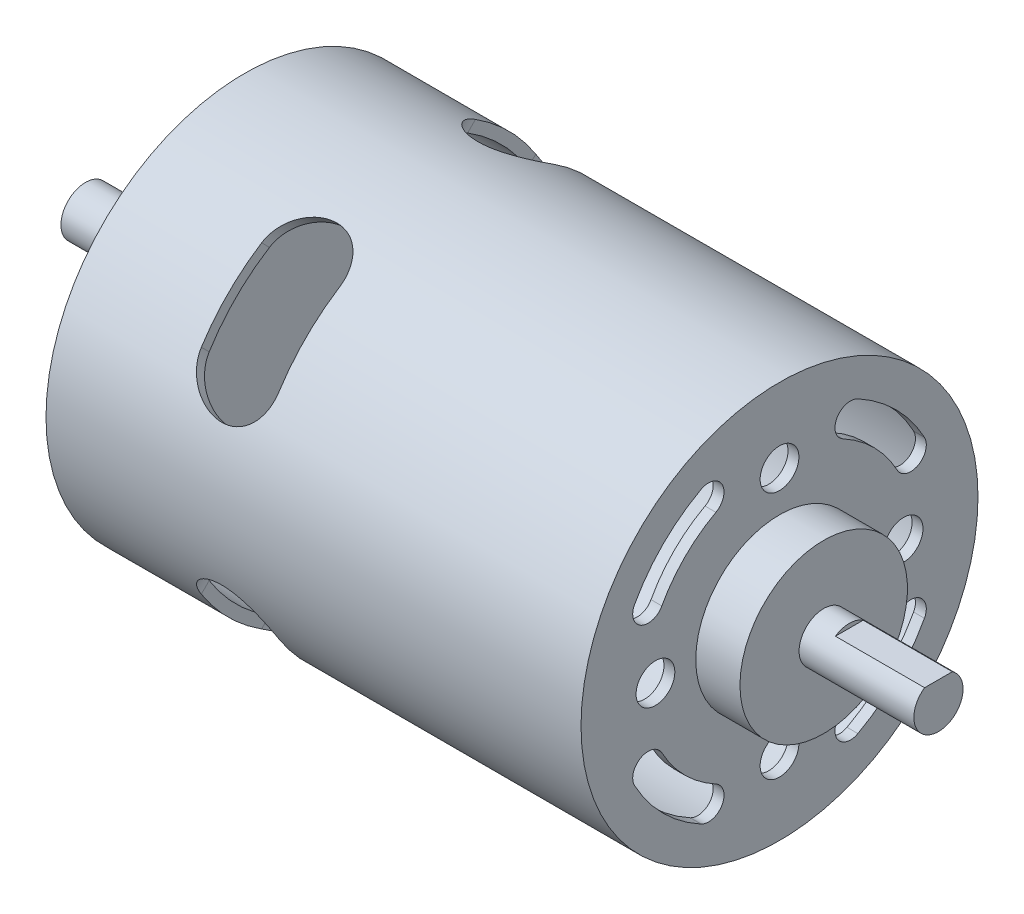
from build123d import *

# Parameters (mm, degrees)
ENL_V_MAT_EXTRU_2_REACH      = 79.921
ESQUISSE4_R                  = 2.5
ENL_V_MAT_EXTRU_3_DEPTH      = 78.92124229
R_P_TITION_CIRCULAIRE1_COUNT = 2
R_P_TITION_CIRCULAIRE1_ANGLE = 90
BOSS_EXTRU_1_DEPTH           = 8
ENL_V_MAT_EXTRU_4_DEPTH      = 11.5


with BuildPart() as part:
    # Esquisse3 → R_vol.-Mince1 (revolve)
    with BuildSketch(Plane.XY, mode=Mode.PRIVATE) as r_vol_mince1_sk:
        Polygon((0, 0), (0, 25.6), (69, 25.6), (69, 0), (67.6, 0), (67.6, 24.2), (1.4, 24.2), (1.4, 0), align=None)
    revolve(r_vol_mince1_sk.sketch.rotate(Axis((0, 0, 0), (1, 0, 0)), 90), axis=Axis((0, 0, 0), (1, 0, 0)))

    # Esquisse4 → Enl_v. mat.-Extru.2 (cut, up to next)
    with BuildSketch(Plane(origin=(69, 0, 0), x_dir=(0, 0, -1), z_dir=(1, 0, 0)), mode=Mode.PRIVATE) as enl_v_mat_extru_2_sk1:
        with Locations((0, 16)):
            Circle(ESQUISSE4_R)
    enl_v_mat_extru_2_tool1 = extrude(enl_v_mat_extru_2_sk1.sketch, amount=-ENL_V_MAT_EXTRU_2_REACH, mode=Mode.PRIVATE) & part.part
    # Esquisse4 → Enl_v. mat.-Extru.2 (cut, up to next)
    with BuildSketch(Plane(origin=(69, 0, 0), x_dir=(0, 0, -1), z_dir=(1, 0, 0)), mode=Mode.PRIVATE) as enl_v_mat_extru_2_sk2:
        with Locations((16, 0)):
            Circle(ESQUISSE4_R)
    enl_v_mat_extru_2_tool2 = extrude(enl_v_mat_extru_2_sk2.sketch, amount=-ENL_V_MAT_EXTRU_2_REACH, mode=Mode.PRIVATE) & part.part
    # Esquisse4 → Enl_v. mat.-Extru.2 (cut, up to next)
    with BuildSketch(Plane(origin=(69, 0, 0), x_dir=(0, 0, -1), z_dir=(1, 0, 0)), mode=Mode.PRIVATE) as enl_v_mat_extru_2_sk3:
        with Locations((0, -16)):
            Circle(ESQUISSE4_R)
    enl_v_mat_extru_2_tool3 = extrude(enl_v_mat_extru_2_sk3.sketch, amount=-ENL_V_MAT_EXTRU_2_REACH, mode=Mode.PRIVATE) & part.part
    # Esquisse4 → Enl_v. mat.-Extru.2 (cut, up to next)
    with BuildSketch(Plane(origin=(69, 0, 0), x_dir=(0, 0, -1), z_dir=(1, 0, 0)), mode=Mode.PRIVATE) as enl_v_mat_extru_2_sk4:
        with Locations((-16, 0)):
            Circle(ESQUISSE4_R)
    enl_v_mat_extru_2_tool4 = extrude(enl_v_mat_extru_2_sk4.sketch, amount=-ENL_V_MAT_EXTRU_2_REACH, mode=Mode.PRIVATE) & part.part
    # Esquisse4 → Enl_v. mat.-Extru.2 (cut, up to next)
    with BuildSketch(Plane(origin=(69, 0, 0), x_dir=(0, 0, -1), z_dir=(1, 0, 0)), mode=Mode.PRIVATE) as enl_v_mat_extru_2_sk5:
        with BuildLine():
            ThreePointArc((-10.106508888, 18.692805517), (-15.0260191, 15.0260191), (-18.692805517, 10.106508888))
            ThreePointArc((-18.692805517, 10.106508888), (-17.884683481, 7.395985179), (-15.174159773, 8.204107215))
            ThreePointArc((-15.174159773, 8.204107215), (-12.197591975, 12.197591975), (-8.204107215, 15.174159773))
            ThreePointArc((-8.204107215, 15.174159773), (-7.395985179, 17.884683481), (-10.106508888, 18.692805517))
        make_face()
    enl_v_mat_extru_2_tool5 = extrude(enl_v_mat_extru_2_sk5.sketch, amount=-ENL_V_MAT_EXTRU_2_REACH, mode=Mode.PRIVATE) & part.part
    # Esquisse4 → Enl_v. mat.-Extru.2 (cut, up to next)
    with BuildSketch(Plane(origin=(69, 0, 0), x_dir=(0, 0, -1), z_dir=(1, 0, 0)), mode=Mode.PRIVATE) as enl_v_mat_extru_2_sk6:
        with BuildLine():
            ThreePointArc((18.692805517, 10.106508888), (15.0260191, 15.0260191), (10.106508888, 18.692805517))
            ThreePointArc((10.106508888, 18.692805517), (7.395985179, 17.884683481), (8.204107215, 15.174159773))
            ThreePointArc((8.204107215, 15.174159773), (12.197591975, 12.197591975), (15.174159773, 8.204107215))
            ThreePointArc((15.174159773, 8.204107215), (17.884683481, 7.395985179), (18.692805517, 10.106508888))
        make_face()
    enl_v_mat_extru_2_tool6 = extrude(enl_v_mat_extru_2_sk6.sketch, amount=-ENL_V_MAT_EXTRU_2_REACH, mode=Mode.PRIVATE) & part.part
    # Esquisse4 → Enl_v. mat.-Extru.2 (cut, up to next)
    with BuildSketch(Plane(origin=(69, 0, 0), x_dir=(0, 0, -1), z_dir=(1, 0, 0)), mode=Mode.PRIVATE) as enl_v_mat_extru_2_sk7:
        with BuildLine():
            ThreePointArc((10.106508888, -18.692805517), (15.0260191, -15.0260191), (18.692805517, -10.106508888))
            ThreePointArc((18.692805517, -10.106508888), (17.884683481, -7.395985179), (15.174159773, -8.204107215))
            ThreePointArc((15.174159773, -8.204107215), (12.197591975, -12.197591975), (8.204107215, -15.174159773))
            ThreePointArc((8.204107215, -15.174159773), (7.395985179, -17.884683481), (10.106508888, -18.692805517))
        make_face()
    enl_v_mat_extru_2_tool7 = extrude(enl_v_mat_extru_2_sk7.sketch, amount=-ENL_V_MAT_EXTRU_2_REACH, mode=Mode.PRIVATE) & part.part
    # Esquisse4 → Enl_v. mat.-Extru.2 (cut, up to next)
    with BuildSketch(Plane(origin=(69, 0, 0), x_dir=(0, 0, -1), z_dir=(1, 0, 0)), mode=Mode.PRIVATE) as enl_v_mat_extru_2_sk8:
        with BuildLine():
            ThreePointArc((-18.692805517, -10.106508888), (-15.0260191, -15.0260191), (-10.106508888, -18.692805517))
            ThreePointArc((-10.106508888, -18.692805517), (-7.395985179, -17.884683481), (-8.204107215, -15.174159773))
            ThreePointArc((-8.204107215, -15.174159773), (-12.197591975, -12.197591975), (-15.174159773, -8.204107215))
            ThreePointArc((-15.174159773, -8.204107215), (-17.884683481, -7.395985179), (-18.692805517, -10.106508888))
        make_face()
    enl_v_mat_extru_2_tool8 = extrude(enl_v_mat_extru_2_sk8.sketch, amount=-ENL_V_MAT_EXTRU_2_REACH, mode=Mode.PRIVATE) & part.part
    add(enl_v_mat_extru_2_tool1.solids().sort_by_distance((69, 16, 0))[0], mode=Mode.SUBTRACT)
    add(enl_v_mat_extru_2_tool2.solids().sort_by_distance((69, 0, -16))[0], mode=Mode.SUBTRACT)
    add(enl_v_mat_extru_2_tool3.solids().sort_by_distance((69, -16, 0))[0], mode=Mode.SUBTRACT)
    add(enl_v_mat_extru_2_tool4.solids().sort_by_distance((69, 0, 16))[0], mode=Mode.SUBTRACT)
    add(enl_v_mat_extru_2_tool5.solids().sort_by_distance((69, 13.339134, 13.339134))[0], mode=Mode.SUBTRACT)
    add(enl_v_mat_extru_2_tool6.solids().sort_by_distance((69, 13.339134, -13.339134))[0], mode=Mode.SUBTRACT)
    add(enl_v_mat_extru_2_tool7.solids().sort_by_distance((69, -13.339134, -13.339134))[0], mode=Mode.SUBTRACT)
    add(enl_v_mat_extru_2_tool8.solids().sort_by_distance((69, -13.339134, 13.339134))[0], mode=Mode.SUBTRACT)

    # Esquisse5 → Enl_v. mat.-Extru.3 (cut, symmetric)
    with BuildSketch(Plane(origin=(0, 0, 0), x_dir=(1, 0, 0), z_dir=(0, 0.7071067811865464, -0.7071067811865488))):
        with BuildLine():
            Line((16, -5.5), (16, 5.5))
            ThreePointArc((16, 5.5), (21, 10.5), (26, 5.5))
            Line((26, 5.5), (26, -5.5))
            ThreePointArc((26, -5.5), (21, -10.5), (16, -5.5))
        make_face()
    enl_v_mat_extru_3 = extrude(amount=ENL_V_MAT_EXTRU_3_DEPTH, both=True, mode=Mode.SUBTRACT)

    # R_p_tition circulaire1: Enl_v. mat.-Extru.3 ×2 about axis
    r_p_tition_circulaire1_axis = Axis((0, 0, 0), (-1, 0, 0))
    for i in range(1, R_P_TITION_CIRCULAIRE1_COUNT):
        add(enl_v_mat_extru_3.rotate(r_p_tition_circulaire1_axis, i * R_P_TITION_CIRCULAIRE1_ANGLE / (R_P_TITION_CIRCULAIRE1_COUNT - 1)), mode=Mode.SUBTRACT)

    # Esquisse6 → R_volution2 (revolve)
    with BuildSketch(Plane(origin=(0, 0, 0), x_dir=(1, 0, 0), z_dir=(0, 1, 0)), mode=Mode.PRIVATE) as r_volution2_sk:
        Polygon((0, 0), (0, 10.5), (-8.5, 10.5), (-8.5, 3.175), (-20.5, 3.175), (-20.5, 0), align=None)
    revolve(r_volution2_sk.sketch.rotate(Axis((-20.936451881, 0, 0), (1, 0, 0)), 180), axis=Axis((-20.936451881, 0, 0), (1, 0, 0)))

    # Esquisse7 → R_volution3 (revolve)
    with BuildSketch(Plane(origin=(0, 0, 0), x_dir=(1, 0, 0), z_dir=(0, 1, 0)), mode=Mode.PRIVATE) as r_volution3_sk:
        Polygon((69, 10.8), (74.7, 10.8), (74.7, 3.175), (89.5, 3.175), (89.5, 0), (69, 0), align=None)
    revolve(r_volution3_sk.sketch.rotate(Axis((0, 0, 0), (1, 0, 0)), 180), axis=Axis((0, 0, 0), (1, 0, 0)))

    # Esquisse8 → Boss.-Extru.1 (add)
    with BuildSketch(Plane.ZY):
        Polygon((-16.369521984, 13.046120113), (-16.652364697, 13.328962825), (-13.328962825, 16.652364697), (-13.046120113, 16.369521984), align=None)
        Polygon((16.369521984, -13.046120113), (16.652364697, -13.328962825), (13.328962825, -16.652364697), (13.046120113, -16.369521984), align=None)
    extrude(amount=BOSS_EXTRU_1_DEPTH)

    # Esquisse9 → Enl_v. mat.-Extru.4 (cut)
    with BuildSketch(Plane(origin=(89.5, 0, 0), x_dir=(0, 0, -1), z_dir=(1, 0, 0))):
        with BuildLine():
            Line((-1.78605711, 2.625), (1.78605711, 2.625))
            ThreePointArc((1.78605711, 2.625), (0, 3.175), (-1.78605711, 2.625))
        make_face()
    extrude(amount=-ENL_V_MAT_EXTRU_4_DEPTH, mode=Mode.SUBTRACT)


solid = part.part
